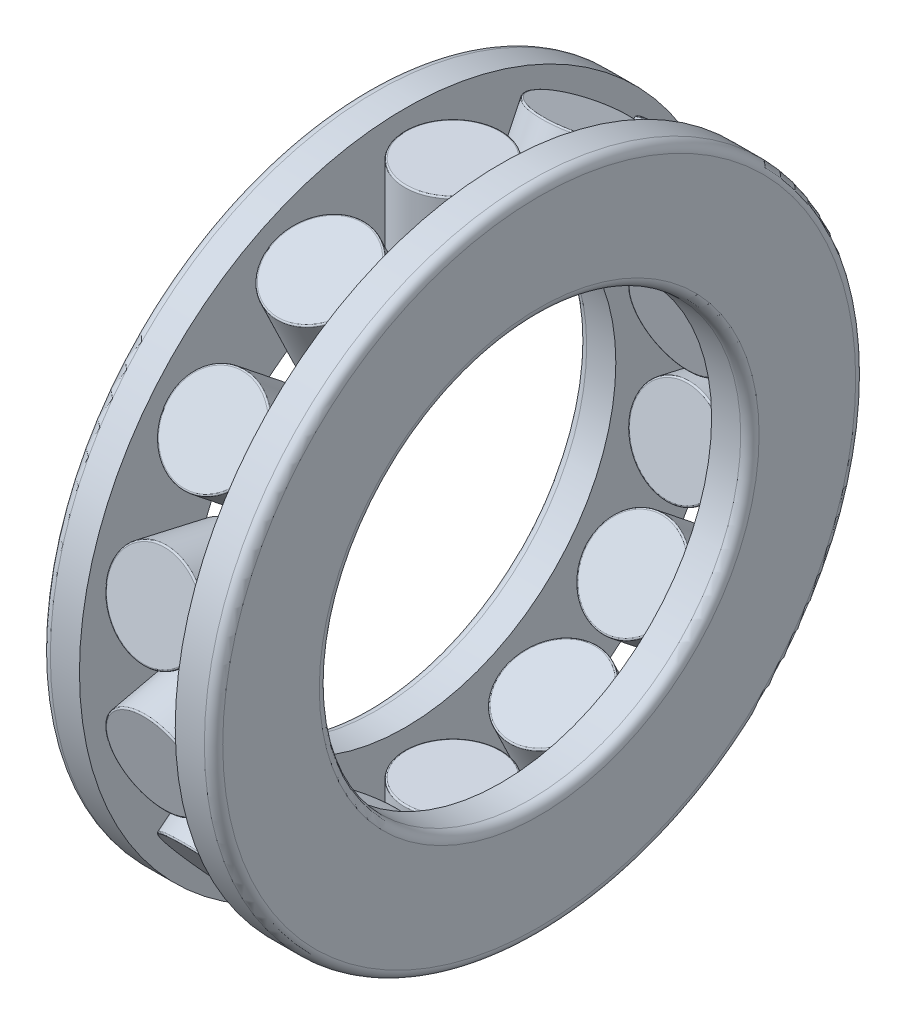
from build123d import *

# Parameters (mm, degrees)
ROLLERSDETAILED_COUNT = 14
ROLLERSDETAILED_ANGLE = 334.285714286


with BuildPart() as part:
    # InnRacSke → Race (revolve)
    with BuildSketch(Plane.XY, mode=Mode.PRIVATE) as race_sk:
        with BuildLine():
            Line((-7.9375, 34.925), (-12.7635, 34.925))
            ThreePointArc((-12.7635, 34.925), (-13.841130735, 35.371369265), (-14.2875, 36.449))
            Line((-14.2875, 36.449), (-14.2875, 52.451))
            ThreePointArc((-14.2875, 52.451), (-13.841130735, 53.528630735), (-12.7635, 53.975))
            Line((-12.7635, 53.975), (-7.9375, 53.975))
            Line((-7.9375, 53.975), (-7.9375, 34.925))
        make_face()
    race = revolve(race_sk.sketch.rotate(Axis((-34.925, 0, 0), (1, 0, 0)), 270), axis=Axis((-34.925, 0, 0), (1, 0, 0)))

    # RolDetSke → RollerDetailed (revolve)
    with BuildSketch(Plane.XY, mode=Mode.PRIVATE) as rollerdetailed_sk:
        with BuildLine():
            Line((0, 50.8), (7.7231875, 50.8))
            ThreePointArc((7.7231875, 50.8), (7.902792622, 50.725605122), (7.9771875, 50.546))
            Line((7.9771875, 50.546), (7.9771875, 38.354))
            ThreePointArc((7.9771875, 38.354), (7.902792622, 38.174394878), (7.7231875, 38.1))
            Line((7.7231875, 38.1), (0, 38.1))
            Line((0, 38.1), (0, 50.8))
        make_face()
    rollerdetailed = revolve(rollerdetailed_sk.sketch.rotate(Axis((0, 33.02, 0), (0, 1, 0)), 270), axis=Axis((0, 33.02, 0), (0, 1, 0)))

    # Mirror1: Race across plane
    add(race.mirror(Plane(origin=(0, 0, 0), x_dir=(0, 0, 1), z_dir=(1, 0, 0))))

    # RollersDetailed: RollerDetailed ×14 about axis
    rollersdetailed_axis = Axis((-50, 0, 0), (1, 0, 0))
    for i in range(1, ROLLERSDETAILED_COUNT):
        add(rollerdetailed.rotate(rollersdetailed_axis, i * ROLLERSDETAILED_ANGLE / (ROLLERSDETAILED_COUNT - 1)))


solid = part.part
